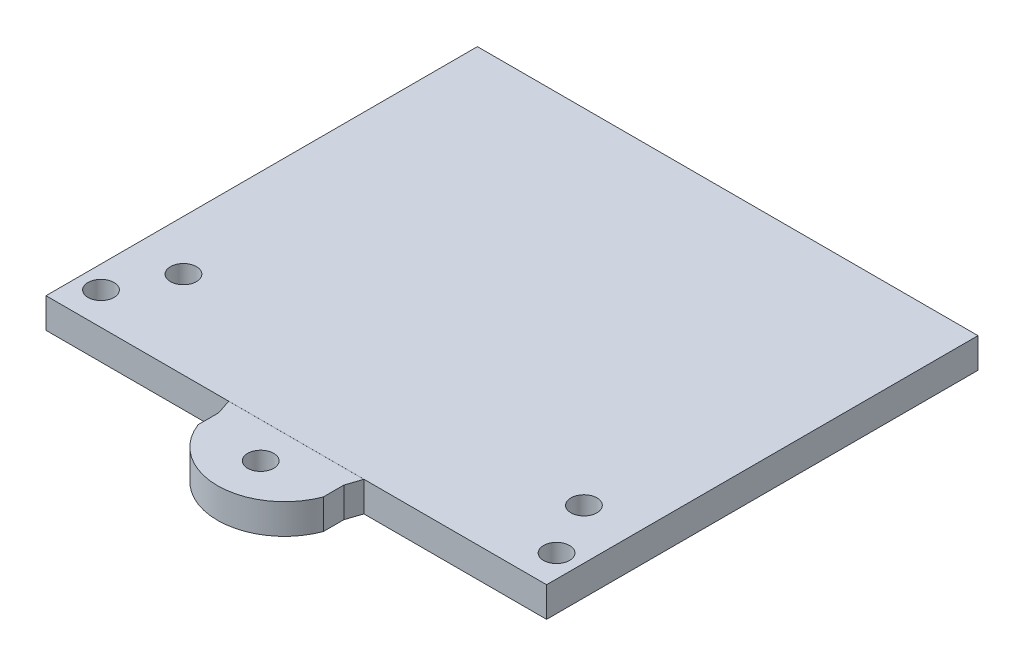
from build123d import *

# Parameters (mm, degrees)
SKETCH1_W           = 100000
SKETCH1_H           = 113460.006713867
BOSS_EXTRUDE2_DEPTH = 6000
SKETCH4_R           = 2600.001829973
BOSS_EXTRUDE3_DEPTH = 6000
SKETCH7_R           = 2600.000245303
SKETCH7_R_2         = 2599.998342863
SKETCH7_R_3         = 2600.005059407
SKETCH7_R_4         = 2600.006522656
CUT_EXTRUDE3_DEPTH  = 6500
SCALE1_SCALE        = 0.001
SKETCH8_W           = 100
SKETCH8_H           = 6
CUT_EXTRUDE4_DEPTH  = 27.279999


with BuildPart() as part:
    # Sketch1 → Boss-Extrude2 (new body)
    with BuildSketch(Plane(origin=(0, 0, 0), x_dir=(1, 0, 0), z_dir=(0, 1, 0))):
        with Locations((0, -229250.007629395)):
            Rectangle(SKETCH1_W, SKETCH1_H)
    extrude(amount=-BOSS_EXTRUDE2_DEPTH)

    # Sketch4 → Boss-Extrude3 (add)
    with BuildSketch(Plane(origin=(0, -6010, 0), x_dir=(-1, 0, 0), z_dir=(0, -1, 0))):
        with BuildLine():
            Line((12500, -288980.010986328), (13500, -285980.010986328))
            Line((13500, -285980.010986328), (-13500, -285980.010986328))
            Line((-13500, -285980.010986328), (-12500, -288980.010986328))
            Line((-12500, -288980.010986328), (-12500, -293095.001220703))
            ThreePointArc((-12500, -293095.001220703), (0, -301709.97605495), (12500, -293095.001220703))
            Line((12500, -293095.001220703), (12500, -288980.010986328))
        make_face()
        with Locations(Location((0.002235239, -293094.995074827, 0), (0, 0, 90))):
            Circle(SKETCH4_R, mode=Mode.SUBTRACT)
    extrude(amount=-BOSS_EXTRUDE3_DEPTH)

    # Sketch7 → Cut-Extrude3 (cut)
    with BuildSketch(Plane(origin=(0, -6010, 0), x_dir=(-1, 0, 0), z_dir=(0, -1, 0))):
        with Locations(Location((45499.995606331, -279495.003650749, 0), (0, 0, 270))):
            Circle(SKETCH7_R)
        with Locations(Location((-45499.999862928, -279495.002562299, 0), (0, 0, 270))):
            Circle(SKETCH7_R_2)
        with Locations(Location((40000.003107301, -268520.004272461, 0), (0, 0, 270))):
            Circle(SKETCH7_R_3)
        with Locations(Location((-39999.998203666, -268519.992852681, 0), (0, 0, 270))):
            Circle(SKETCH7_R_4)
    extrude(amount=-CUT_EXTRUDE3_DEPTH, mode=Mode.SUBTRACT)


with BuildPart() as part_1:
    # Scale1: scaled about (0, 0, 0)
    add(part.part.scale(SCALE1_SCALE))

    # Sketch8 → Cut-Extrude4 (cut)
    with BuildSketch(Plane(origin=(0, 0, 172.520004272), x_dir=(-1, 0, 0), z_dir=(0, 0, -1))):
        with Locations((0, -3)):
            Rectangle(SKETCH8_W, SKETCH8_H)
    extrude(amount=-CUT_EXTRUDE4_DEPTH, mode=Mode.SUBTRACT)


solid = part_1.part
